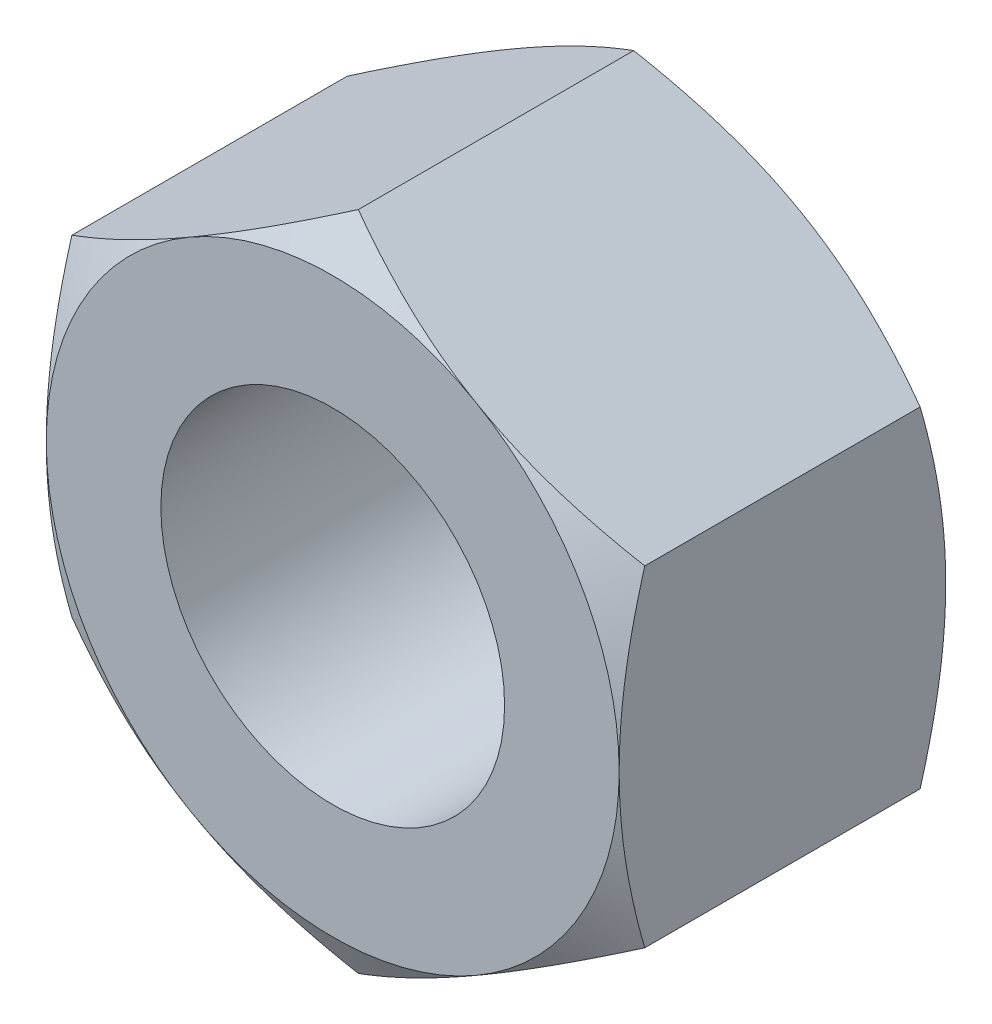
from build123d import *

# Parameters (mm, degrees)
BASE_EXTRUSION_DEPTH    = 5.7
ESQUISSE3_R             = 3
ENL_V_MAT_EXTRU_1_DEPTH = 10.530127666


with BuildPart() as part:
    # Esquisse1 → Base-Extrusion (new body)
    with BuildSketch(Plane.XY):
        Polygon((5, -2.886751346), (5, 2.886751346), (0, 5.773502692), (-5, 2.886751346), (-5, -2.886751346), (0, -5.773502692), align=None)
    extrude(amount=-BASE_EXTRUSION_DEPTH)

    # Esquisse2 → Enl_vement de mati_re-R_volution1 (revolve, cut)
    with BuildSketch(Plane(origin=(0, 0, 0), x_dir=(1, 0, 0), z_dir=(0, 1, 0)), mode=Mode.PRIVATE) as enl_vement_de_mati_re_r_volution1_sk:
        Polygon((-5, 0), (-10.936344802, 0), (-10.936344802, 5.7), (-5, 5.7), (-9.936344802, 2.85), align=None)
    revolve(enl_vement_de_mati_re_r_volution1_sk.sketch.rotate(Axis((0, 0, -5.7), (0, 0, 1)), 180), axis=Axis((0, 0, -5.7), (0, 0, 1)), mode=Mode.SUBTRACT)

    # Esquisse3 → Enl_v. mat.-Extru.1 (cut, through all)
    with BuildSketch(Plane.XY):
        Circle(ESQUISSE3_R)
    extrude(amount=-ENL_V_MAT_EXTRU_1_DEPTH, mode=Mode.SUBTRACT)


solid = part.part
